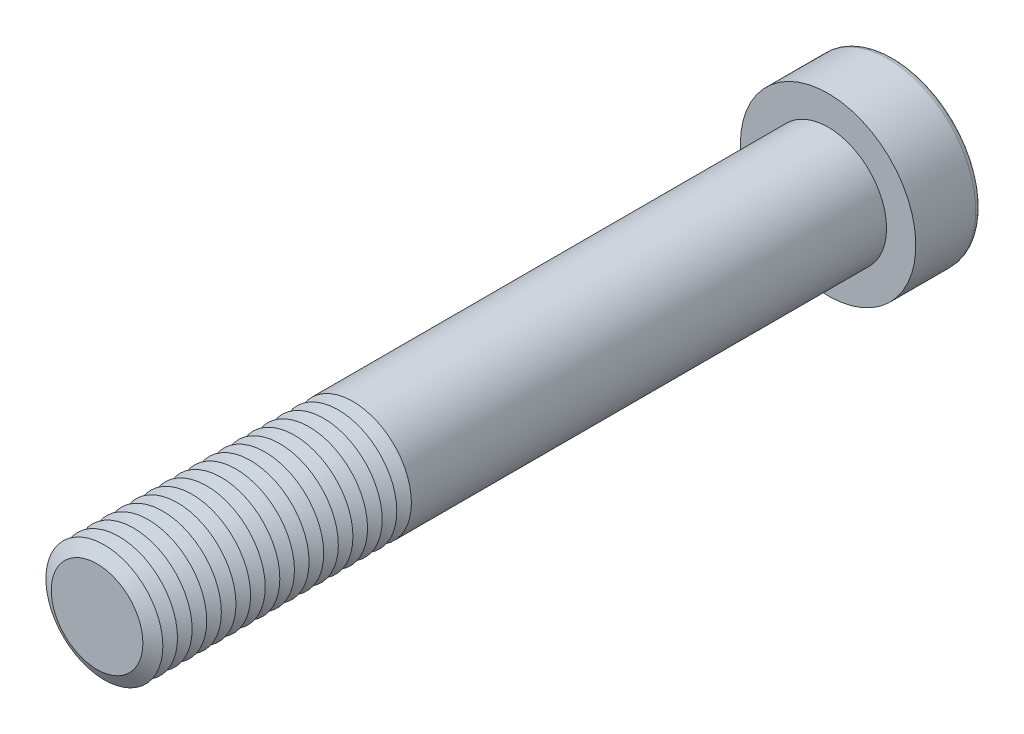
ISO-10303-21;
HEADER;
FILE_DESCRIPTION(('STEP AP214'),'2;1');
FILE_NAME('part.step','',(''),(''),'','','');
FILE_SCHEMA(('AUTOMOTIVE_DESIGN { 1 0 10303 214 1 1 1 1 }'));
ENDSEC;
DATA;
#1=APPLICATION_CONTEXT('core data for automotive mechanical design processes');
#2=APPLICATION_PROTOCOL_DEFINITION('international standard','automotive_design',2000,#1);
#3=PRODUCT_CONTEXT('',#1,'mechanical');
#4=PRODUCT('Part','Part','',(#3));
#5=PRODUCT_RELATED_PRODUCT_CATEGORY('part','',(#4));
#6=PRODUCT_DEFINITION_FORMATION('','',#4);
#7=PRODUCT_DEFINITION_CONTEXT('part definition',#1,'design');
#8=PRODUCT_DEFINITION('design','',#6,#7);
#9=PRODUCT_DEFINITION_SHAPE('','',#8);
#10=(LENGTH_UNIT() NAMED_UNIT(*) SI_UNIT(.MILLI.,.METRE.));
#11=(NAMED_UNIT(*) PLANE_ANGLE_UNIT() SI_UNIT($,.RADIAN.));
#12=(NAMED_UNIT(*) SI_UNIT($,.STERADIAN.) SOLID_ANGLE_UNIT());
#13=UNCERTAINTY_MEASURE_WITH_UNIT(LENGTH_MEASURE(1.E-05),#10,'distance_accuracy_value','');
#14=(GEOMETRIC_REPRESENTATION_CONTEXT(3) GLOBAL_UNCERTAINTY_ASSIGNED_CONTEXT((#13)) GLOBAL_UNIT_ASSIGNED_CONTEXT((#10,
#11,#12)) REPRESENTATION_CONTEXT('',''));
#15=CARTESIAN_POINT('',(0.,0.,0.));
#16=DIRECTION('',(0.,0.,1.));
#17=DIRECTION('',(1.,0.,0.));
#18=AXIS2_PLACEMENT_3D('',#15,#16,#17);
#19=CARTESIAN_POINT('',(0.,0.,93.));
#20=DIRECTION('',(0.,0.,1.));
#21=DIRECTION('',(1.,0.,0.));
#22=AXIS2_PLACEMENT_3D('',#19,#20,#21);
#23=CONICAL_SURFACE('',#22,8.,1.0471975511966);
#24=CARTESIAN_POINT('',(0.,0.,92.));
#25=DIRECTION('',(0.,0.,1.));
#26=DIRECTION('',(1.,0.,0.));
#27=AXIS2_PLACEMENT_3D('',#24,#25,#26);
#28=CIRCLE('',#27,6.26794919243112);
#29=CARTESIAN_POINT('',(6.26794919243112,0.,92.));
#30=VERTEX_POINT('',#29);
#31=EDGE_CURVE('E314',#30,#30,#28,.T.);
#32=ORIENTED_EDGE('',*,*,#31,.T.);
#33=EDGE_LOOP('',(#32));
#34=FACE_BOUND('',#33,.T.);
#35=CARTESIAN_POINT('',(0.,0.,93.));
#36=DIRECTION('',(0.,0.,1.));
#37=DIRECTION('',(1.,0.,0.));
#38=AXIS2_PLACEMENT_3D('',#35,#36,#37);
#39=CIRCLE('',#38,8.);
#40=CARTESIAN_POINT('',(8.,0.,93.));
#41=VERTEX_POINT('',#40);
#42=EDGE_CURVE('E317',#41,#41,#39,.T.);
#43=ORIENTED_EDGE('',*,*,#42,.F.);
#44=EDGE_LOOP('',(#43));
#45=FACE_BOUND('',#44,.T.);
#46=ADVANCED_FACE('F39',(#34,#45),#23,.T.);
#47=CARTESIAN_POINT('',(0.,0.,92.));
#48=DIRECTION('',(0.,0.,-1.));
#49=DIRECTION('',(-1.,0.,0.));
#50=AXIS2_PLACEMENT_3D('',#47,#48,#49);
#51=CONICAL_SURFACE('',#50,6.26794919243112,1.0471975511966);
#52=CARTESIAN_POINT('',(0.,0.,91.));
#53=DIRECTION('',(0.,0.,1.));
#54=DIRECTION('',(1.,0.,0.));
#55=AXIS2_PLACEMENT_3D('',#52,#53,#54);
#56=CIRCLE('',#55,8.);
#57=CARTESIAN_POINT('',(8.,0.,91.));
#58=VERTEX_POINT('',#57);
#59=EDGE_CURVE('E325',#58,#58,#56,.T.);
#60=ORIENTED_EDGE('',*,*,#59,.T.);
#61=EDGE_LOOP('',(#60));
#62=FACE_BOUND('',#61,.T.);
#63=ORIENTED_EDGE('',*,*,#31,.F.);
#64=EDGE_LOOP('',(#63));
#65=FACE_BOUND('',#64,.T.);
#66=ADVANCED_FACE('F245',(#62,#65),#51,.T.);
#67=CARTESIAN_POINT('',(0.,0.,100.));
#68=DIRECTION('',(0.,0.,1.));
#69=DIRECTION('',(1.,0.,0.));
#70=AXIS2_PLACEMENT_3D('',#67,#68,#69);
#71=PLANE('',#70);
#72=CARTESIAN_POINT('',(0.,0.,100.));
#73=DIRECTION('',(0.,0.,1.));
#74=DIRECTION('',(1.,0.,0.));
#75=AXIS2_PLACEMENT_3D('',#72,#73,#74);
#76=CIRCLE('',#75,6.26794919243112);
#77=CARTESIAN_POINT('',(6.26794919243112,0.,100.));
#78=VERTEX_POINT('',#77);
#79=EDGE_CURVE('E174',#78,#78,#76,.T.);
#80=ORIENTED_EDGE('',*,*,#79,.T.);
#81=EDGE_LOOP('',(#80));
#82=FACE_BOUND('',#81,.T.);
#83=ADVANCED_FACE('F251',(#82),#71,.T.);
#84=CARTESIAN_POINT('',(0.,0.,100.));
#85=DIRECTION('',(0.,0.,-1.));
#86=DIRECTION('',(-1.,0.,0.));
#87=AXIS2_PLACEMENT_3D('',#84,#85,#86);
#88=CONICAL_SURFACE('',#87,6.26794919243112,1.0471975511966);
#89=CARTESIAN_POINT('',(0.,0.,99.));
#90=DIRECTION('',(0.,0.,1.));
#91=DIRECTION('',(1.,0.,0.));
#92=AXIS2_PLACEMENT_3D('',#89,#90,#91);
#93=CIRCLE('',#92,8.);
#94=CARTESIAN_POINT('',(8.,0.,99.));
#95=VERTEX_POINT('',#94);
#96=EDGE_CURVE('E291',#95,#95,#93,.T.);
#97=ORIENTED_EDGE('',*,*,#96,.T.);
#98=EDGE_LOOP('',(#97));
#99=FACE_BOUND('',#98,.T.);
#100=ORIENTED_EDGE('',*,*,#79,.F.);
#101=EDGE_LOOP('',(#100));
#102=FACE_BOUND('',#101,.T.);
#103=ADVANCED_FACE('F199',(#99,#102),#88,.T.);
#104=CARTESIAN_POINT('',(0.,0.,99.));
#105=DIRECTION('',(0.,0.,1.));
#106=DIRECTION('',(1.,0.,0.));
#107=AXIS2_PLACEMENT_3D('',#104,#105,#106);
#108=CONICAL_SURFACE('',#107,8.,1.0471975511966);
#109=CARTESIAN_POINT('',(0.,0.,98.));
#110=DIRECTION('',(0.,0.,1.));
#111=DIRECTION('',(1.,0.,0.));
#112=AXIS2_PLACEMENT_3D('',#109,#110,#111);
#113=CIRCLE('',#112,6.26794919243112);
#114=CARTESIAN_POINT('',(6.26794919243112,0.,98.));
#115=VERTEX_POINT('',#114);
#116=EDGE_CURVE('E288',#115,#115,#113,.T.);
#117=ORIENTED_EDGE('',*,*,#116,.T.);
#118=EDGE_LOOP('',(#117));
#119=FACE_BOUND('',#118,.T.);
#120=ORIENTED_EDGE('',*,*,#96,.F.);
#121=EDGE_LOOP('',(#120));
#122=FACE_BOUND('',#121,.T.);
#123=ADVANCED_FACE('F277',(#119,#122),#108,.T.);
#124=CARTESIAN_POINT('',(0.,0.,98.));
#125=DIRECTION('',(0.,0.,-1.));
#126=DIRECTION('',(-1.,0.,0.));
#127=AXIS2_PLACEMENT_3D('',#124,#125,#126);
#128=CONICAL_SURFACE('',#127,6.26794919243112,1.0471975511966);
#129=CARTESIAN_POINT('',(0.,0.,97.));
#130=DIRECTION('',(0.,0.,1.));
#131=DIRECTION('',(1.,0.,0.));
#132=AXIS2_PLACEMENT_3D('',#129,#130,#131);
#133=CIRCLE('',#132,8.);
#134=CARTESIAN_POINT('',(8.,0.,97.));
#135=VERTEX_POINT('',#134);
#136=EDGE_CURVE('E300',#135,#135,#133,.T.);
#137=ORIENTED_EDGE('',*,*,#136,.T.);
#138=EDGE_LOOP('',(#137));
#139=FACE_BOUND('',#138,.T.);
#140=ORIENTED_EDGE('',*,*,#116,.F.);
#141=EDGE_LOOP('',(#140));
#142=FACE_BOUND('',#141,.T.);
#143=ADVANCED_FACE('F274',(#139,#142),#128,.T.);
#144=CARTESIAN_POINT('',(0.,0.,97.));
#145=DIRECTION('',(0.,0.,1.));
#146=DIRECTION('',(1.,0.,0.));
#147=AXIS2_PLACEMENT_3D('',#144,#145,#146);
#148=CONICAL_SURFACE('',#147,8.,1.0471975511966);
#149=CARTESIAN_POINT('',(0.,0.,96.));
#150=DIRECTION('',(0.,0.,1.));
#151=DIRECTION('',(1.,0.,0.));
#152=AXIS2_PLACEMENT_3D('',#149,#150,#151);
#153=CIRCLE('',#152,6.26794919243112);
#154=CARTESIAN_POINT('',(6.26794919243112,0.,96.));
#155=VERTEX_POINT('',#154);
#156=EDGE_CURVE('E293',#155,#155,#153,.T.);
#157=ORIENTED_EDGE('',*,*,#156,.T.);
#158=EDGE_LOOP('',(#157));
#159=FACE_BOUND('',#158,.T.);
#160=ORIENTED_EDGE('',*,*,#136,.F.);
#161=EDGE_LOOP('',(#160));
#162=FACE_BOUND('',#161,.T.);
#163=ADVANCED_FACE('F270',(#159,#162),#148,.T.);
#164=CARTESIAN_POINT('',(0.,0.,96.));
#165=DIRECTION('',(0.,0.,-1.));
#166=DIRECTION('',(-1.,0.,0.));
#167=AXIS2_PLACEMENT_3D('',#164,#165,#166);
#168=CONICAL_SURFACE('',#167,6.26794919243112,1.0471975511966);
#169=CARTESIAN_POINT('',(0.,0.,95.));
#170=DIRECTION('',(0.,0.,1.));
#171=DIRECTION('',(1.,0.,0.));
#172=AXIS2_PLACEMENT_3D('',#169,#170,#171);
#173=CIRCLE('',#172,8.);
#174=CARTESIAN_POINT('',(8.,0.,95.));
#175=VERTEX_POINT('',#174);
#176=EDGE_CURVE('E310',#175,#175,#173,.T.);
#177=ORIENTED_EDGE('',*,*,#176,.T.);
#178=EDGE_LOOP('',(#177));
#179=FACE_BOUND('',#178,.T.);
#180=ORIENTED_EDGE('',*,*,#156,.F.);
#181=EDGE_LOOP('',(#180));
#182=FACE_BOUND('',#181,.T.);
#183=ADVANCED_FACE('F266',(#179,#182),#168,.T.);
#184=CARTESIAN_POINT('',(0.,0.,95.));
#185=DIRECTION('',(0.,0.,1.));
#186=DIRECTION('',(1.,0.,0.));
#187=AXIS2_PLACEMENT_3D('',#184,#185,#186);
#188=CONICAL_SURFACE('',#187,8.,1.0471975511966);
#189=CARTESIAN_POINT('',(0.,0.,94.));
#190=DIRECTION('',(0.,0.,1.));
#191=DIRECTION('',(1.,0.,0.));
#192=AXIS2_PLACEMENT_3D('',#189,#190,#191);
#193=CIRCLE('',#192,6.26794919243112);
#194=CARTESIAN_POINT('',(6.26794919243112,0.,94.));
#195=VERTEX_POINT('',#194);
#196=EDGE_CURVE('E306',#195,#195,#193,.T.);
#197=ORIENTED_EDGE('',*,*,#196,.T.);
#198=EDGE_LOOP('',(#197));
#199=FACE_BOUND('',#198,.T.);
#200=ORIENTED_EDGE('',*,*,#176,.F.);
#201=EDGE_LOOP('',(#200));
#202=FACE_BOUND('',#201,.T.);
#203=ADVANCED_FACE('F262',(#199,#202),#188,.T.);
#204=CARTESIAN_POINT('',(0.,0.,94.));
#205=DIRECTION('',(0.,0.,-1.));
#206=DIRECTION('',(-1.,0.,0.));
#207=AXIS2_PLACEMENT_3D('',#204,#205,#206);
#208=CONICAL_SURFACE('',#207,6.26794919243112,1.0471975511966);
#209=ORIENTED_EDGE('',*,*,#42,.T.);
#210=EDGE_LOOP('',(#209));
#211=FACE_BOUND('',#210,.T.);
#212=ORIENTED_EDGE('',*,*,#196,.F.);
#213=EDGE_LOOP('',(#212));
#214=FACE_BOUND('',#213,.T.);
#215=ADVANCED_FACE('F258',(#211,#214),#208,.T.);
#216=CARTESIAN_POINT('',(0.,0.,91.));
#217=DIRECTION('',(0.,0.,1.));
#218=DIRECTION('',(1.,0.,0.));
#219=AXIS2_PLACEMENT_3D('',#216,#217,#218);
#220=CONICAL_SURFACE('',#219,8.,1.0471975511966);
#221=CARTESIAN_POINT('',(0.,0.,90.));
#222=DIRECTION('',(0.,0.,1.));
#223=DIRECTION('',(1.,0.,0.));
#224=AXIS2_PLACEMENT_3D('',#221,#222,#223);
#225=CIRCLE('',#224,6.26794919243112);
#226=CARTESIAN_POINT('',(6.26794919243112,0.,90.));
#227=VERTEX_POINT('',#226);
#228=EDGE_CURVE('E321',#227,#227,#225,.T.);
#229=ORIENTED_EDGE('',*,*,#228,.T.);
#230=EDGE_LOOP('',(#229));
#231=FACE_BOUND('',#230,.T.);
#232=ORIENTED_EDGE('',*,*,#59,.F.);
#233=EDGE_LOOP('',(#232));
#234=FACE_BOUND('',#233,.T.);
#235=ADVANCED_FACE('F261',(#231,#234),#220,.T.);
#236=CARTESIAN_POINT('',(0.,0.,90.));
#237=DIRECTION('',(0.,0.,-1.));
#238=DIRECTION('',(-1.,0.,0.));
#239=AXIS2_PLACEMENT_3D('',#236,#237,#238);
#240=CONICAL_SURFACE('',#239,6.26794919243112,1.0471975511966);
#241=CARTESIAN_POINT('',(0.,0.,89.));
#242=DIRECTION('',(0.,0.,1.));
#243=DIRECTION('',(1.,0.,0.));
#244=AXIS2_PLACEMENT_3D('',#241,#242,#243);
#245=CIRCLE('',#244,8.);
#246=CARTESIAN_POINT('',(8.,0.,89.));
#247=VERTEX_POINT('',#246);
#248=EDGE_CURVE('E333',#247,#247,#245,.T.);
#249=ORIENTED_EDGE('',*,*,#248,.T.);
#250=EDGE_LOOP('',(#249));
#251=FACE_BOUND('',#250,.T.);
#252=ORIENTED_EDGE('',*,*,#228,.F.);
#253=EDGE_LOOP('',(#252));
#254=FACE_BOUND('',#253,.T.);
#255=ADVANCED_FACE('F528',(#251,#254),#240,.T.);
#256=CARTESIAN_POINT('',(0.,0.,89.));
#257=DIRECTION('',(0.,0.,1.));
#258=DIRECTION('',(1.,0.,0.));
#259=AXIS2_PLACEMENT_3D('',#256,#257,#258);
#260=CONICAL_SURFACE('',#259,8.,1.0471975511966);
#261=CARTESIAN_POINT('',(0.,0.,88.));
#262=DIRECTION('',(0.,0.,1.));
#263=DIRECTION('',(1.,0.,0.));
#264=AXIS2_PLACEMENT_3D('',#261,#262,#263);
#265=CIRCLE('',#264,6.26794919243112);
#266=CARTESIAN_POINT('',(6.26794919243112,0.,88.));
#267=VERTEX_POINT('',#266);
#268=EDGE_CURVE('E329',#267,#267,#265,.T.);
#269=ORIENTED_EDGE('',*,*,#268,.T.);
#270=EDGE_LOOP('',(#269));
#271=FACE_BOUND('',#270,.T.);
#272=ORIENTED_EDGE('',*,*,#248,.F.);
#273=EDGE_LOOP('',(#272));
#274=FACE_BOUND('',#273,.T.);
#275=ADVANCED_FACE('F524',(#271,#274),#260,.T.);
#276=CARTESIAN_POINT('',(0.,0.,88.));
#277=DIRECTION('',(0.,0.,-1.));
#278=DIRECTION('',(-1.,0.,0.));
#279=AXIS2_PLACEMENT_3D('',#276,#277,#278);
#280=CONICAL_SURFACE('',#279,6.26794919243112,1.0471975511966);
#281=CARTESIAN_POINT('',(0.,0.,87.));
#282=DIRECTION('',(0.,0.,1.));
#283=DIRECTION('',(1.,0.,0.));
#284=AXIS2_PLACEMENT_3D('',#281,#282,#283);
#285=CIRCLE('',#284,8.);
#286=CARTESIAN_POINT('',(8.,0.,87.));
#287=VERTEX_POINT('',#286);
#288=EDGE_CURVE('E341',#287,#287,#285,.T.);
#289=ORIENTED_EDGE('',*,*,#288,.T.);
#290=EDGE_LOOP('',(#289));
#291=FACE_BOUND('',#290,.T.);
#292=ORIENTED_EDGE('',*,*,#268,.F.);
#293=EDGE_LOOP('',(#292));
#294=FACE_BOUND('',#293,.T.);
#295=ADVANCED_FACE('F520',(#291,#294),#280,.T.);
#296=CARTESIAN_POINT('',(0.,0.,87.));
#297=DIRECTION('',(0.,0.,1.));
#298=DIRECTION('',(1.,0.,0.));
#299=AXIS2_PLACEMENT_3D('',#296,#297,#298);
#300=CONICAL_SURFACE('',#299,8.,1.0471975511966);
#301=CARTESIAN_POINT('',(0.,0.,86.));
#302=DIRECTION('',(0.,0.,1.));
#303=DIRECTION('',(1.,0.,0.));
#304=AXIS2_PLACEMENT_3D('',#301,#302,#303);
#305=CIRCLE('',#304,6.26794919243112);
#306=CARTESIAN_POINT('',(6.26794919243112,0.,86.));
#307=VERTEX_POINT('',#306);
#308=EDGE_CURVE('E337',#307,#307,#305,.T.);
#309=ORIENTED_EDGE('',*,*,#308,.T.);
#310=EDGE_LOOP('',(#309));
#311=FACE_BOUND('',#310,.T.);
#312=ORIENTED_EDGE('',*,*,#288,.F.);
#313=EDGE_LOOP('',(#312));
#314=FACE_BOUND('',#313,.T.);
#315=ADVANCED_FACE('F516',(#311,#314),#300,.T.);
#316=CARTESIAN_POINT('',(0.,0.,86.));
#317=DIRECTION('',(0.,0.,-1.));
#318=DIRECTION('',(-1.,0.,0.));
#319=AXIS2_PLACEMENT_3D('',#316,#317,#318);
#320=CONICAL_SURFACE('',#319,6.26794919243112,1.0471975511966);
#321=CARTESIAN_POINT('',(0.,0.,85.));
#322=DIRECTION('',(0.,0.,1.));
#323=DIRECTION('',(1.,0.,0.));
#324=AXIS2_PLACEMENT_3D('',#321,#322,#323);
#325=CIRCLE('',#324,8.);
#326=CARTESIAN_POINT('',(8.,0.,85.));
#327=VERTEX_POINT('',#326);
#328=EDGE_CURVE('E349',#327,#327,#325,.T.);
#329=ORIENTED_EDGE('',*,*,#328,.T.);
#330=EDGE_LOOP('',(#329));
#331=FACE_BOUND('',#330,.T.);
#332=ORIENTED_EDGE('',*,*,#308,.F.);
#333=EDGE_LOOP('',(#332));
#334=FACE_BOUND('',#333,.T.);
#335=ADVANCED_FACE('F512',(#331,#334),#320,.T.);
#336=CARTESIAN_POINT('',(0.,0.,85.));
#337=DIRECTION('',(0.,0.,1.));
#338=DIRECTION('',(1.,0.,0.));
#339=AXIS2_PLACEMENT_3D('',#336,#337,#338);
#340=CONICAL_SURFACE('',#339,8.,1.0471975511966);
#341=CARTESIAN_POINT('',(0.,0.,84.));
#342=DIRECTION('',(0.,0.,1.));
#343=DIRECTION('',(1.,0.,0.));
#344=AXIS2_PLACEMENT_3D('',#341,#342,#343);
#345=CIRCLE('',#344,6.26794919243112);
#346=CARTESIAN_POINT('',(6.26794919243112,0.,84.));
#347=VERTEX_POINT('',#346);
#348=EDGE_CURVE('E345',#347,#347,#345,.T.);
#349=ORIENTED_EDGE('',*,*,#348,.T.);
#350=EDGE_LOOP('',(#349));
#351=FACE_BOUND('',#350,.T.);
#352=ORIENTED_EDGE('',*,*,#328,.F.);
#353=EDGE_LOOP('',(#352));
#354=FACE_BOUND('',#353,.T.);
#355=ADVANCED_FACE('F508',(#351,#354),#340,.T.);
#356=CARTESIAN_POINT('',(0.,0.,84.));
#357=DIRECTION('',(0.,0.,-1.));
#358=DIRECTION('',(-1.,0.,0.));
#359=AXIS2_PLACEMENT_3D('',#356,#357,#358);
#360=CONICAL_SURFACE('',#359,6.26794919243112,1.0471975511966);
#361=CARTESIAN_POINT('',(0.,0.,83.));
#362=DIRECTION('',(0.,0.,1.));
#363=DIRECTION('',(1.,0.,0.));
#364=AXIS2_PLACEMENT_3D('',#361,#362,#363);
#365=CIRCLE('',#364,8.);
#366=CARTESIAN_POINT('',(8.,0.,83.));
#367=VERTEX_POINT('',#366);
#368=EDGE_CURVE('E357',#367,#367,#365,.T.);
#369=ORIENTED_EDGE('',*,*,#368,.T.);
#370=EDGE_LOOP('',(#369));
#371=FACE_BOUND('',#370,.T.);
#372=ORIENTED_EDGE('',*,*,#348,.F.);
#373=EDGE_LOOP('',(#372));
#374=FACE_BOUND('',#373,.T.);
#375=ADVANCED_FACE('F504',(#371,#374),#360,.T.);
#376=CARTESIAN_POINT('',(0.,0.,83.));
#377=DIRECTION('',(0.,0.,1.));
#378=DIRECTION('',(1.,0.,0.));
#379=AXIS2_PLACEMENT_3D('',#376,#377,#378);
#380=CONICAL_SURFACE('',#379,8.,1.0471975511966);
#381=CARTESIAN_POINT('',(0.,0.,82.));
#382=DIRECTION('',(0.,0.,1.));
#383=DIRECTION('',(1.,0.,0.));
#384=AXIS2_PLACEMENT_3D('',#381,#382,#383);
#385=CIRCLE('',#384,6.26794919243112);
#386=CARTESIAN_POINT('',(6.26794919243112,0.,82.));
#387=VERTEX_POINT('',#386);
#388=EDGE_CURVE('E353',#387,#387,#385,.T.);
#389=ORIENTED_EDGE('',*,*,#388,.T.);
#390=EDGE_LOOP('',(#389));
#391=FACE_BOUND('',#390,.T.);
#392=ORIENTED_EDGE('',*,*,#368,.F.);
#393=EDGE_LOOP('',(#392));
#394=FACE_BOUND('',#393,.T.);
#395=ADVANCED_FACE('F500',(#391,#394),#380,.T.);
#396=CARTESIAN_POINT('',(0.,0.,82.));
#397=DIRECTION('',(0.,0.,-1.));
#398=DIRECTION('',(-1.,0.,0.));
#399=AXIS2_PLACEMENT_3D('',#396,#397,#398);
#400=CONICAL_SURFACE('',#399,6.26794919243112,1.0471975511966);
#401=CARTESIAN_POINT('',(0.,0.,81.));
#402=DIRECTION('',(0.,0.,1.));
#403=DIRECTION('',(1.,0.,0.));
#404=AXIS2_PLACEMENT_3D('',#401,#402,#403);
#405=CIRCLE('',#404,8.);
#406=CARTESIAN_POINT('',(8.,0.,81.));
#407=VERTEX_POINT('',#406);
#408=EDGE_CURVE('E365',#407,#407,#405,.T.);
#409=ORIENTED_EDGE('',*,*,#408,.T.);
#410=EDGE_LOOP('',(#409));
#411=FACE_BOUND('',#410,.T.);
#412=ORIENTED_EDGE('',*,*,#388,.F.);
#413=EDGE_LOOP('',(#412));
#414=FACE_BOUND('',#413,.T.);
#415=ADVANCED_FACE('F496',(#411,#414),#400,.T.);
#416=CARTESIAN_POINT('',(0.,0.,81.));
#417=DIRECTION('',(0.,0.,1.));
#418=DIRECTION('',(1.,0.,0.));
#419=AXIS2_PLACEMENT_3D('',#416,#417,#418);
#420=CONICAL_SURFACE('',#419,8.,1.0471975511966);
#421=CARTESIAN_POINT('',(0.,0.,80.));
#422=DIRECTION('',(0.,0.,1.));
#423=DIRECTION('',(1.,0.,0.));
#424=AXIS2_PLACEMENT_3D('',#421,#422,#423);
#425=CIRCLE('',#424,6.26794919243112);
#426=CARTESIAN_POINT('',(6.26794919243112,0.,80.));
#427=VERTEX_POINT('',#426);
#428=EDGE_CURVE('E361',#427,#427,#425,.T.);
#429=ORIENTED_EDGE('',*,*,#428,.T.);
#430=EDGE_LOOP('',(#429));
#431=FACE_BOUND('',#430,.T.);
#432=ORIENTED_EDGE('',*,*,#408,.F.);
#433=EDGE_LOOP('',(#432));
#434=FACE_BOUND('',#433,.T.);
#435=ADVANCED_FACE('F492',(#431,#434),#420,.T.);
#436=CARTESIAN_POINT('',(0.,0.,80.));
#437=DIRECTION('',(0.,0.,-1.));
#438=DIRECTION('',(-1.,0.,0.));
#439=AXIS2_PLACEMENT_3D('',#436,#437,#438);
#440=CONICAL_SURFACE('',#439,6.26794919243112,1.0471975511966);
#441=CARTESIAN_POINT('',(0.,0.,79.));
#442=DIRECTION('',(0.,0.,1.));
#443=DIRECTION('',(1.,0.,0.));
#444=AXIS2_PLACEMENT_3D('',#441,#442,#443);
#445=CIRCLE('',#444,8.);
#446=CARTESIAN_POINT('',(8.,0.,79.));
#447=VERTEX_POINT('',#446);
#448=EDGE_CURVE('E373',#447,#447,#445,.T.);
#449=ORIENTED_EDGE('',*,*,#448,.T.);
#450=EDGE_LOOP('',(#449));
#451=FACE_BOUND('',#450,.T.);
#452=ORIENTED_EDGE('',*,*,#428,.F.);
#453=EDGE_LOOP('',(#452));
#454=FACE_BOUND('',#453,.T.);
#455=ADVANCED_FACE('F488',(#451,#454),#440,.T.);
#456=CARTESIAN_POINT('',(0.,0.,79.));
#457=DIRECTION('',(0.,0.,1.));
#458=DIRECTION('',(1.,0.,0.));
#459=AXIS2_PLACEMENT_3D('',#456,#457,#458);
#460=CONICAL_SURFACE('',#459,8.,1.0471975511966);
#461=CARTESIAN_POINT('',(0.,0.,78.));
#462=DIRECTION('',(0.,0.,1.));
#463=DIRECTION('',(1.,0.,0.));
#464=AXIS2_PLACEMENT_3D('',#461,#462,#463);
#465=CIRCLE('',#464,6.26794919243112);
#466=CARTESIAN_POINT('',(6.26794919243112,0.,78.));
#467=VERTEX_POINT('',#466);
#468=EDGE_CURVE('E369',#467,#467,#465,.T.);
#469=ORIENTED_EDGE('',*,*,#468,.T.);
#470=EDGE_LOOP('',(#469));
#471=FACE_BOUND('',#470,.T.);
#472=ORIENTED_EDGE('',*,*,#448,.F.);
#473=EDGE_LOOP('',(#472));
#474=FACE_BOUND('',#473,.T.);
#475=ADVANCED_FACE('F484',(#471,#474),#460,.T.);
#476=CARTESIAN_POINT('',(0.,0.,78.));
#477=DIRECTION('',(0.,0.,-1.));
#478=DIRECTION('',(-1.,0.,0.));
#479=AXIS2_PLACEMENT_3D('',#476,#477,#478);
#480=CONICAL_SURFACE('',#479,6.26794919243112,1.0471975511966);
#481=CARTESIAN_POINT('',(0.,0.,77.));
#482=DIRECTION('',(0.,0.,1.));
#483=DIRECTION('',(1.,0.,0.));
#484=AXIS2_PLACEMENT_3D('',#481,#482,#483);
#485=CIRCLE('',#484,8.);
#486=CARTESIAN_POINT('',(8.,0.,77.));
#487=VERTEX_POINT('',#486);
#488=EDGE_CURVE('E380',#487,#487,#485,.T.);
#489=ORIENTED_EDGE('',*,*,#488,.T.);
#490=EDGE_LOOP('',(#489));
#491=FACE_BOUND('',#490,.T.);
#492=ORIENTED_EDGE('',*,*,#468,.F.);
#493=EDGE_LOOP('',(#492));
#494=FACE_BOUND('',#493,.T.);
#495=ADVANCED_FACE('F480',(#491,#494),#480,.T.);
#496=CARTESIAN_POINT('',(0.,0.,77.));
#497=DIRECTION('',(0.,0.,1.));
#498=DIRECTION('',(1.,0.,0.));
#499=AXIS2_PLACEMENT_3D('',#496,#497,#498);
#500=CONICAL_SURFACE('',#499,8.,1.0471975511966);
#501=CARTESIAN_POINT('',(0.,0.,76.));
#502=DIRECTION('',(0.,0.,1.));
#503=DIRECTION('',(1.,0.,0.));
#504=AXIS2_PLACEMENT_3D('',#501,#502,#503);
#505=CIRCLE('',#504,6.26794919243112);
#506=CARTESIAN_POINT('',(6.26794919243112,0.,76.));
#507=VERTEX_POINT('',#506);
#508=EDGE_CURVE('E376',#507,#507,#505,.T.);
#509=ORIENTED_EDGE('',*,*,#508,.T.);
#510=EDGE_LOOP('',(#509));
#511=FACE_BOUND('',#510,.T.);
#512=ORIENTED_EDGE('',*,*,#488,.F.);
#513=EDGE_LOOP('',(#512));
#514=FACE_BOUND('',#513,.T.);
#515=ADVANCED_FACE('F476',(#511,#514),#500,.T.);
#516=CARTESIAN_POINT('',(0.,0.,76.));
#517=DIRECTION('',(0.,0.,-1.));
#518=DIRECTION('',(-1.,0.,0.));
#519=AXIS2_PLACEMENT_3D('',#516,#517,#518);
#520=CONICAL_SURFACE('',#519,6.26794919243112,1.0471975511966);
#521=CARTESIAN_POINT('',(0.,0.,75.));
#522=DIRECTION('',(0.,0.,1.));
#523=DIRECTION('',(1.,0.,0.));
#524=AXIS2_PLACEMENT_3D('',#521,#522,#523);
#525=CIRCLE('',#524,8.);
#526=CARTESIAN_POINT('',(8.,0.,75.));
#527=VERTEX_POINT('',#526);
#528=EDGE_CURVE('E387',#527,#527,#525,.T.);
#529=ORIENTED_EDGE('',*,*,#528,.T.);
#530=EDGE_LOOP('',(#529));
#531=FACE_BOUND('',#530,.T.);
#532=ORIENTED_EDGE('',*,*,#508,.F.);
#533=EDGE_LOOP('',(#532));
#534=FACE_BOUND('',#533,.T.);
#535=ADVANCED_FACE('F472',(#531,#534),#520,.T.);
#536=CARTESIAN_POINT('',(0.,0.,75.));
#537=DIRECTION('',(0.,0.,1.));
#538=DIRECTION('',(1.,0.,0.));
#539=AXIS2_PLACEMENT_3D('',#536,#537,#538);
#540=CONICAL_SURFACE('',#539,8.,1.0471975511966);
#541=CARTESIAN_POINT('',(0.,0.,74.));
#542=DIRECTION('',(0.,0.,1.));
#543=DIRECTION('',(1.,0.,0.));
#544=AXIS2_PLACEMENT_3D('',#541,#542,#543);
#545=CIRCLE('',#544,6.26794919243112);
#546=CARTESIAN_POINT('',(6.26794919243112,0.,74.));
#547=VERTEX_POINT('',#546);
#548=EDGE_CURVE('E383',#547,#547,#545,.T.);
#549=ORIENTED_EDGE('',*,*,#548,.T.);
#550=EDGE_LOOP('',(#549));
#551=FACE_BOUND('',#550,.T.);
#552=ORIENTED_EDGE('',*,*,#528,.F.);
#553=EDGE_LOOP('',(#552));
#554=FACE_BOUND('',#553,.T.);
#555=ADVANCED_FACE('F468',(#551,#554),#540,.T.);
#556=CARTESIAN_POINT('',(0.,0.,74.));
#557=DIRECTION('',(0.,0.,-1.));
#558=DIRECTION('',(-1.,0.,0.));
#559=AXIS2_PLACEMENT_3D('',#556,#557,#558);
#560=CONICAL_SURFACE('',#559,6.26794919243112,1.0471975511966);
#561=CARTESIAN_POINT('',(0.,0.,73.));
#562=DIRECTION('',(0.,0.,1.));
#563=DIRECTION('',(1.,0.,0.));
#564=AXIS2_PLACEMENT_3D('',#561,#562,#563);
#565=CIRCLE('',#564,8.);
#566=CARTESIAN_POINT('',(8.,0.,73.));
#567=VERTEX_POINT('',#566);
#568=EDGE_CURVE('E395',#567,#567,#565,.T.);
#569=ORIENTED_EDGE('',*,*,#568,.T.);
#570=EDGE_LOOP('',(#569));
#571=FACE_BOUND('',#570,.T.);
#572=ORIENTED_EDGE('',*,*,#548,.F.);
#573=EDGE_LOOP('',(#572));
#574=FACE_BOUND('',#573,.T.);
#575=ADVANCED_FACE('F464',(#571,#574),#560,.T.);
#576=CARTESIAN_POINT('',(0.,0.,73.));
#577=DIRECTION('',(0.,0.,1.));
#578=DIRECTION('',(1.,0.,0.));
#579=AXIS2_PLACEMENT_3D('',#576,#577,#578);
#580=CONICAL_SURFACE('',#579,8.,1.0471975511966);
#581=CARTESIAN_POINT('',(0.,0.,72.));
#582=DIRECTION('',(0.,0.,1.));
#583=DIRECTION('',(1.,0.,0.));
#584=AXIS2_PLACEMENT_3D('',#581,#582,#583);
#585=CIRCLE('',#584,6.26794919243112);
#586=CARTESIAN_POINT('',(6.26794919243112,0.,72.));
#587=VERTEX_POINT('',#586);
#588=EDGE_CURVE('E391',#587,#587,#585,.T.);
#589=ORIENTED_EDGE('',*,*,#588,.T.);
#590=EDGE_LOOP('',(#589));
#591=FACE_BOUND('',#590,.T.);
#592=ORIENTED_EDGE('',*,*,#568,.F.);
#593=EDGE_LOOP('',(#592));
#594=FACE_BOUND('',#593,.T.);
#595=ADVANCED_FACE('F460',(#591,#594),#580,.T.);
#596=CARTESIAN_POINT('',(0.,0.,72.));
#597=DIRECTION('',(0.,0.,-1.));
#598=DIRECTION('',(-1.,0.,0.));
#599=AXIS2_PLACEMENT_3D('',#596,#597,#598);
#600=CONICAL_SURFACE('',#599,6.26794919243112,1.0471975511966);
#601=CARTESIAN_POINT('',(0.,0.,71.));
#602=DIRECTION('',(0.,0.,1.));
#603=DIRECTION('',(1.,0.,0.));
#604=AXIS2_PLACEMENT_3D('',#601,#602,#603);
#605=CIRCLE('',#604,8.);
#606=CARTESIAN_POINT('',(8.,0.,71.));
#607=VERTEX_POINT('',#606);
#608=EDGE_CURVE('E403',#607,#607,#605,.T.);
#609=ORIENTED_EDGE('',*,*,#608,.T.);
#610=EDGE_LOOP('',(#609));
#611=FACE_BOUND('',#610,.T.);
#612=ORIENTED_EDGE('',*,*,#588,.F.);
#613=EDGE_LOOP('',(#612));
#614=FACE_BOUND('',#613,.T.);
#615=ADVANCED_FACE('F456',(#611,#614),#600,.T.);
#616=CARTESIAN_POINT('',(0.,0.,71.));
#617=DIRECTION('',(0.,0.,1.));
#618=DIRECTION('',(1.,0.,0.));
#619=AXIS2_PLACEMENT_3D('',#616,#617,#618);
#620=CONICAL_SURFACE('',#619,8.,1.0471975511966);
#621=CARTESIAN_POINT('',(0.,0.,70.));
#622=DIRECTION('',(0.,0.,1.));
#623=DIRECTION('',(1.,0.,0.));
#624=AXIS2_PLACEMENT_3D('',#621,#622,#623);
#625=CIRCLE('',#624,6.26794919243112);
#626=CARTESIAN_POINT('',(6.26794919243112,0.,70.));
#627=VERTEX_POINT('',#626);
#628=EDGE_CURVE('E399',#627,#627,#625,.T.);
#629=ORIENTED_EDGE('',*,*,#628,.T.);
#630=EDGE_LOOP('',(#629));
#631=FACE_BOUND('',#630,.T.);
#632=ORIENTED_EDGE('',*,*,#608,.F.);
#633=EDGE_LOOP('',(#632));
#634=FACE_BOUND('',#633,.T.);
#635=ADVANCED_FACE('F452',(#631,#634),#620,.T.);
#636=CARTESIAN_POINT('',(0.,0.,70.));
#637=DIRECTION('',(0.,0.,-1.));
#638=DIRECTION('',(-1.,0.,0.));
#639=AXIS2_PLACEMENT_3D('',#636,#637,#638);
#640=CONICAL_SURFACE('',#639,6.26794919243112,1.0471975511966);
#641=CARTESIAN_POINT('',(0.,0.,69.));
#642=DIRECTION('',(0.,0.,1.));
#643=DIRECTION('',(1.,0.,0.));
#644=AXIS2_PLACEMENT_3D('',#641,#642,#643);
#645=CIRCLE('',#644,8.);
#646=CARTESIAN_POINT('',(8.,0.,69.));
#647=VERTEX_POINT('',#646);
#648=EDGE_CURVE('E411',#647,#647,#645,.T.);
#649=ORIENTED_EDGE('',*,*,#648,.T.);
#650=EDGE_LOOP('',(#649));
#651=FACE_BOUND('',#650,.T.);
#652=ORIENTED_EDGE('',*,*,#628,.F.);
#653=EDGE_LOOP('',(#652));
#654=FACE_BOUND('',#653,.T.);
#655=ADVANCED_FACE('F448',(#651,#654),#640,.T.);
#656=CARTESIAN_POINT('',(0.,0.,69.));
#657=DIRECTION('',(0.,0.,1.));
#658=DIRECTION('',(1.,0.,0.));
#659=AXIS2_PLACEMENT_3D('',#656,#657,#658);
#660=CONICAL_SURFACE('',#659,8.,1.0471975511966);
#661=CARTESIAN_POINT('',(0.,0.,68.));
#662=DIRECTION('',(0.,0.,1.));
#663=DIRECTION('',(1.,0.,0.));
#664=AXIS2_PLACEMENT_3D('',#661,#662,#663);
#665=CIRCLE('',#664,6.26794919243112);
#666=CARTESIAN_POINT('',(6.26794919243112,0.,68.));
#667=VERTEX_POINT('',#666);
#668=EDGE_CURVE('E407',#667,#667,#665,.T.);
#669=ORIENTED_EDGE('',*,*,#668,.T.);
#670=EDGE_LOOP('',(#669));
#671=FACE_BOUND('',#670,.T.);
#672=ORIENTED_EDGE('',*,*,#648,.F.);
#673=EDGE_LOOP('',(#672));
#674=FACE_BOUND('',#673,.T.);
#675=ADVANCED_FACE('F443',(#671,#674),#660,.T.);
#676=CARTESIAN_POINT('',(0.,0.,68.));
#677=DIRECTION('',(0.,0.,-1.));
#678=DIRECTION('',(-1.,0.,0.));
#679=AXIS2_PLACEMENT_3D('',#676,#677,#678);
#680=CONICAL_SURFACE('',#679,6.26794919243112,1.0471975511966);
#681=CARTESIAN_POINT('',(0.,0.,67.));
#682=DIRECTION('',(0.,0.,1.));
#683=DIRECTION('',(1.,0.,0.));
#684=AXIS2_PLACEMENT_3D('',#681,#682,#683);
#685=CIRCLE('',#684,8.);
#686=CARTESIAN_POINT('',(8.,0.,67.));
#687=VERTEX_POINT('',#686);
#688=EDGE_CURVE('E423',#687,#687,#685,.T.);
#689=ORIENTED_EDGE('',*,*,#688,.T.);
#690=EDGE_LOOP('',(#689));
#691=FACE_BOUND('',#690,.T.);
#692=ORIENTED_EDGE('',*,*,#668,.F.);
#693=EDGE_LOOP('',(#692));
#694=FACE_BOUND('',#693,.T.);
#695=ADVANCED_FACE('F429',(#691,#694),#680,.T.);
#696=CARTESIAN_POINT('',(0.,0.,67.));
#697=DIRECTION('',(0.,0.,1.));
#698=DIRECTION('',(1.,0.,0.));
#699=AXIS2_PLACEMENT_3D('',#696,#697,#698);
#700=CONICAL_SURFACE('',#699,8.,1.0471975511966);
#701=CARTESIAN_POINT('',(0.,0.,66.));
#702=DIRECTION('',(0.,0.,1.));
#703=DIRECTION('',(1.,0.,0.));
#704=AXIS2_PLACEMENT_3D('',#701,#702,#703);
#705=CIRCLE('',#704,6.26794919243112);
#706=CARTESIAN_POINT('',(6.26794919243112,0.,66.));
#707=VERTEX_POINT('',#706);
#708=EDGE_CURVE('E415',#707,#707,#705,.T.);
#709=ORIENTED_EDGE('',*,*,#708,.T.);
#710=EDGE_LOOP('',(#709));
#711=FACE_BOUND('',#710,.T.);
#712=ORIENTED_EDGE('',*,*,#688,.F.);
#713=EDGE_LOOP('',(#712));
#714=FACE_BOUND('',#713,.T.);
#715=ADVANCED_FACE('F432',(#711,#714),#700,.T.);
#716=CARTESIAN_POINT('',(0.,0.,66.));
#717=DIRECTION('',(0.,0.,-1.));
#718=DIRECTION('',(-1.,0.,0.));
#719=AXIS2_PLACEMENT_3D('',#716,#717,#718);
#720=CONICAL_SURFACE('',#719,6.26794919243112,1.0471975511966);
#721=CARTESIAN_POINT('',(0.,0.,65.));
#722=DIRECTION('',(0.,0.,1.));
#723=DIRECTION('',(1.,0.,0.));
#724=AXIS2_PLACEMENT_3D('',#721,#722,#723);
#725=CIRCLE('',#724,8.);
#726=CARTESIAN_POINT('',(8.,0.,65.));
#727=VERTEX_POINT('',#726);
#728=EDGE_CURVE('E419',#727,#727,#725,.T.);
#729=ORIENTED_EDGE('',*,*,#728,.T.);
#730=EDGE_LOOP('',(#729));
#731=FACE_BOUND('',#730,.T.);
#732=ORIENTED_EDGE('',*,*,#708,.F.);
#733=EDGE_LOOP('',(#732));
#734=FACE_BOUND('',#733,.T.);
#735=ADVANCED_FACE('F434',(#731,#734),#720,.T.);
#736=CARTESIAN_POINT('',(0.,0.,0.));
#737=DIRECTION('',(0.,0.,-1.));
#738=DIRECTION('',(-1.,0.,0.));
#739=AXIS2_PLACEMENT_3D('',#736,#737,#738);
#740=CONICAL_SURFACE('',#739,6.,1.0471975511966);
#741=CARTESIAN_POINT('',(0.,0.,3.46410161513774));
#742=VERTEX_POINT('',#741);
#743=VERTEX_LOOP('',#742);
#744=FACE_BOUND('',#743,.T.);
#745=CARTESIAN_POINT('',(0.,0.,0.));
#746=DIRECTION('',(0.,0.,-1.));
#747=DIRECTION('',(-1.,0.,0.));
#748=AXIS2_PLACEMENT_3D('',#745,#746,#747);
#749=CIRCLE('',#748,6.);
#750=CARTESIAN_POINT('',(-5.19615242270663,3.,0.));
#751=VERTEX_POINT('',#750);
#752=CARTESIAN_POINT('',(0.,6.,0.));
#753=VERTEX_POINT('',#752);
#754=EDGE_CURVE('E149',#751,#753,#749,.T.);
#755=ORIENTED_EDGE('',*,*,#754,.T.);
#756=CARTESIAN_POINT('',(0.,0.,0.));
#757=DIRECTION('',(0.,0.,-1.));
#758=DIRECTION('',(-1.,0.,0.));
#759=AXIS2_PLACEMENT_3D('',#756,#757,#758);
#760=CIRCLE('',#759,6.);
#761=CARTESIAN_POINT('',(5.19615242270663,3.,0.));
#762=VERTEX_POINT('',#761);
#763=EDGE_CURVE('E54',#753,#762,#760,.T.);
#764=ORIENTED_EDGE('',*,*,#763,.T.);
#765=CARTESIAN_POINT('',(5.19615242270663,-3.,0.));
#766=VERTEX_POINT('',#765);
#767=EDGE_CURVE('E1058',#762,#766,#760,.T.);
#768=ORIENTED_EDGE('',*,*,#767,.T.);
#769=CARTESIAN_POINT('',(0.,-6.,0.));
#770=VERTEX_POINT('',#769);
#771=EDGE_CURVE('E1056',#766,#770,#760,.T.);
#772=ORIENTED_EDGE('',*,*,#771,.T.);
#773=CARTESIAN_POINT('',(-5.19615242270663,-3.,0.));
#774=VERTEX_POINT('',#773);
#775=EDGE_CURVE('E1050',#770,#774,#760,.T.);
#776=ORIENTED_EDGE('',*,*,#775,.T.);
#777=EDGE_CURVE('E1048',#774,#751,#760,.T.);
#778=ORIENTED_EDGE('',*,*,#777,.T.);
#779=EDGE_LOOP('',(#755,#764,#768,#772,#776,#778));
#780=FACE_BOUND('',#779,.T.);
#781=ADVANCED_FACE('F201',(#744,#780),#740,.F.);
#782=CARTESIAN_POINT('',(0.,0.,0.));
#783=DIRECTION('',(0.,0.,-1.));
#784=DIRECTION('',(-1.,0.,0.));
#785=AXIS2_PLACEMENT_3D('',#782,#783,#784);
#786=PLANE('',#785);
#787=ORIENTED_EDGE('',*,*,#763,.F.);
#788=DIRECTION('',(1.,0.,0.));
#789=VECTOR('',#788,1.);
#790=CARTESIAN_POINT('',(-3.46410161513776,6.,0.));
#791=LINE('',#790,#789);
#792=CARTESIAN_POINT('',(3.46410161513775,6.,0.));
#793=VERTEX_POINT('',#792);
#794=EDGE_CURVE('E1096',#753,#793,#791,.T.);
#795=ORIENTED_EDGE('',*,*,#794,.T.);
#796=DIRECTION('',(0.5,-0.866025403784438,0.));
#797=VECTOR('',#796,1.);
#798=CARTESIAN_POINT('',(3.46410161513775,6.,0.));
#799=LINE('',#798,#797);
#800=EDGE_CURVE('E155',#793,#762,#799,.T.);
#801=ORIENTED_EDGE('',*,*,#800,.T.);
#802=EDGE_LOOP('',(#787,#795,#801));
#803=FACE_BOUND('',#802,.T.);
#804=ADVANCED_FACE('F629',(#803),#786,.T.);
#805=ORIENTED_EDGE('',*,*,#767,.F.);
#806=CARTESIAN_POINT('',(6.92820323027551,0.,0.));
#807=VERTEX_POINT('',#806);
#808=EDGE_CURVE('E1095',#762,#807,#799,.T.);
#809=ORIENTED_EDGE('',*,*,#808,.T.);
#810=DIRECTION('',(-0.5,-0.866025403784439,0.));
#811=VECTOR('',#810,1.);
#812=CARTESIAN_POINT('',(6.92820323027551,0.,0.));
#813=LINE('',#812,#811);
#814=EDGE_CURVE('E1070',#807,#766,#813,.T.);
#815=ORIENTED_EDGE('',*,*,#814,.T.);
#816=EDGE_LOOP('',(#805,#809,#815));
#817=FACE_BOUND('',#816,.T.);
#818=ADVANCED_FACE('F639',(#817),#786,.T.);
#819=ORIENTED_EDGE('',*,*,#771,.F.);
#820=CARTESIAN_POINT('',(3.46410161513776,-6.,0.));
#821=VERTEX_POINT('',#820);
#822=EDGE_CURVE('E1072',#766,#821,#813,.T.);
#823=ORIENTED_EDGE('',*,*,#822,.T.);
#824=DIRECTION('',(-1.,0.,0.));
#825=VECTOR('',#824,1.);
#826=CARTESIAN_POINT('',(3.46410161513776,-6.,0.));
#827=LINE('',#826,#825);
#828=EDGE_CURVE('E1023',#821,#770,#827,.T.);
#829=ORIENTED_EDGE('',*,*,#828,.T.);
#830=EDGE_LOOP('',(#819,#823,#829));
#831=FACE_BOUND('',#830,.T.);
#832=ADVANCED_FACE('F649',(#831),#786,.T.);
#833=ORIENTED_EDGE('',*,*,#775,.F.);
#834=CARTESIAN_POINT('',(-3.46410161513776,-6.,0.));
#835=VERTEX_POINT('',#834);
#836=EDGE_CURVE('E1066',#770,#835,#827,.T.);
#837=ORIENTED_EDGE('',*,*,#836,.T.);
#838=DIRECTION('',(-0.5,0.866025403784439,0.));
#839=VECTOR('',#838,1.);
#840=CARTESIAN_POINT('',(-3.46410161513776,-6.,0.));
#841=LINE('',#840,#839);
#842=EDGE_CURVE('E1068',#835,#774,#841,.T.);
#843=ORIENTED_EDGE('',*,*,#842,.T.);
#844=EDGE_LOOP('',(#833,#837,#843));
#845=FACE_BOUND('',#844,.T.);
#846=ADVANCED_FACE('F657',(#845),#786,.T.);
#847=ORIENTED_EDGE('',*,*,#777,.F.);
#848=CARTESIAN_POINT('',(-6.92820323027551,0.,0.));
#849=VERTEX_POINT('',#848);
#850=EDGE_CURVE('E1074',#774,#849,#841,.T.);
#851=ORIENTED_EDGE('',*,*,#850,.T.);
#852=DIRECTION('',(0.5,0.866025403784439,0.));
#853=VECTOR('',#852,1.);
#854=CARTESIAN_POINT('',(-6.92820323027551,0.,0.));
#855=LINE('',#854,#853);
#856=EDGE_CURVE('E158',#849,#751,#855,.T.);
#857=ORIENTED_EDGE('',*,*,#856,.T.);
#858=EDGE_LOOP('',(#847,#851,#857));
#859=FACE_BOUND('',#858,.T.);
#860=ADVANCED_FACE('F231',(#859),#786,.T.);
#861=ORIENTED_EDGE('',*,*,#754,.F.);
#862=CARTESIAN_POINT('',(-3.46410161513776,6.,0.));
#863=VERTEX_POINT('',#862);
#864=EDGE_CURVE('E1080',#751,#863,#855,.T.);
#865=ORIENTED_EDGE('',*,*,#864,.T.);
#866=EDGE_CURVE('E1092',#863,#753,#791,.T.);
#867=ORIENTED_EDGE('',*,*,#866,.T.);
#868=EDGE_LOOP('',(#861,#865,#867));
#869=FACE_BOUND('',#868,.T.);
#870=ADVANCED_FACE('F641',(#869),#786,.T.);
#871=CARTESIAN_POINT('',(-3.46410161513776,6.,0.));
#872=DIRECTION('',(0.,1.,0.));
#873=DIRECTION('',(0.,0.,1.));
#874=AXIS2_PLACEMENT_3D('',#871,#872,#873);
#875=PLANE('',#874);
#876=DIRECTION('',(0.,0.,-1.));
#877=VECTOR('',#876,1.);
#878=CARTESIAN_POINT('',(-3.46410161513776,6.,0.));
#879=LINE('',#878,#877);
#880=CARTESIAN_POINT('',(-3.46410161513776,6.,-9.));
#881=VERTEX_POINT('',#880);
#882=EDGE_CURVE('E147',#863,#881,#879,.T.);
#883=ORIENTED_EDGE('',*,*,#882,.T.);
#884=CARTESIAN_POINT('',(-9.04322275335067,6.,-10.0515506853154));
#885=CARTESIAN_POINT('',(-8.77229389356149,6.,-9.99107568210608));
#886=CARTESIAN_POINT('',(-8.50119215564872,6.,-9.93136093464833));
#887=CARTESIAN_POINT('',(-7.95855825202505,6.,-9.81386229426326));
#888=CARTESIAN_POINT('',(-7.68702606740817,6.,-9.75607848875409));
#889=CARTESIAN_POINT('',(-7.14318995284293,6.,-9.64279905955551));
#890=CARTESIAN_POINT('',(-6.87088551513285,6.,-9.58730586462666));
#891=CARTESIAN_POINT('',(-6.32570082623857,6.,-9.47922577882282));
#892=CARTESIAN_POINT('',(-6.05282058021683,6.,-9.42663886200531));
#893=CARTESIAN_POINT('',(-5.50875458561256,6.,-9.32550177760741));
#894=CARTESIAN_POINT('',(-5.23757463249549,6.,-9.27692059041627));
#895=CARTESIAN_POINT('',(-4.69446863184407,6.,-9.18413302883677));
#896=CARTESIAN_POINT('',(-4.42254260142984,6.,-9.13992655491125));
#897=CARTESIAN_POINT('',(-3.87790333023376,6.,-9.05690830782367));
#898=CARTESIAN_POINT('',(-3.6051902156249,6.,-9.0180957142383));
#899=CARTESIAN_POINT('',(-3.05890080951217,6.,-8.94703062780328));
#900=CARTESIAN_POINT('',(-2.7853245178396,6.,-8.91477813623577));
#901=CARTESIAN_POINT('',(-2.23425545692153,6.,-8.85776959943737));
#902=CARTESIAN_POINT('',(-1.95675335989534,6.,-8.83310236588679));
#903=CARTESIAN_POINT('',(-1.40107824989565,6.,-8.79298360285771));
#904=CARTESIAN_POINT('',(-1.12290525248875,6.,-8.77753186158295));
#905=CARTESIAN_POINT('',(-0.566293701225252,6.,-8.75674610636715));
#906=CARTESIAN_POINT('',(-0.28785531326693,6.,-8.75140773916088));
#907=CARTESIAN_POINT('',(0.269026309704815,6.,-8.75117360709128));
#908=CARTESIAN_POINT('',(0.547469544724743,6.,-8.75627785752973));
#909=CARTESIAN_POINT('',(1.10511819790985,6.,-8.77664719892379));
#910=CARTESIAN_POINT('',(1.38432206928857,6.,-8.79195380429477));
#911=CARTESIAN_POINT('',(1.94205759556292,6.,-8.83187108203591));
#912=CARTESIAN_POINT('',(2.22058923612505,6.,-8.85648195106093));
#913=CARTESIAN_POINT('',(2.77698779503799,6.,-8.91379497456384));
#914=CARTESIAN_POINT('',(3.0548541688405,6.,-8.94650233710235));
#915=CARTESIAN_POINT('',(3.60969614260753,6.,-9.01868375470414));
#916=CARTESIAN_POINT('',(3.8866717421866,6.,-9.0581578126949));
#917=CARTESIAN_POINT('',(4.44700464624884,6.,-9.14374886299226));
#918=CARTESIAN_POINT('',(4.73033933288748,6.,-9.190012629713));
#919=CARTESIAN_POINT('',(5.29620685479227,6.,-9.28723184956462));
#920=CARTESIAN_POINT('',(5.57873966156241,6.,-9.3381874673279));
#921=CARTESIAN_POINT('',(6.14313105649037,6.,-9.44386031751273));
#922=CARTESIAN_POINT('',(6.42498956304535,6.,-9.49857798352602));
#923=CARTESIAN_POINT('',(6.98810511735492,6.,-9.61103289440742));
#924=CARTESIAN_POINT('',(7.26936215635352,6.,-9.66877018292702));
#925=CARTESIAN_POINT('',(8.11254995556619,6.,-9.84563705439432));
#926=CARTESIAN_POINT('',(8.67372006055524,6.,-9.96838761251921));
#927=CARTESIAN_POINT('',(9.79457370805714,6.,-10.2202420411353));
#928=CARTESIAN_POINT('',(10.3542573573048,6.,-10.3493454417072));
#929=CARTESIAN_POINT('',(11.4657945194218,6.,-10.6103395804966));
#930=CARTESIAN_POINT('',(12.0176605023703,6.,-10.7421773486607));
#931=CARTESIAN_POINT('',(13.1206665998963,6.,-11.0089002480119));
#932=CARTESIAN_POINT('',(13.6718066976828,6.,-11.1437854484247));
#933=CARTESIAN_POINT('',(14.7727697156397,6.,-11.4155878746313));
#934=CARTESIAN_POINT('',(15.3225934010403,6.,-11.5525020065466));
#935=CARTESIAN_POINT('',(16.4217957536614,6.,-11.8280226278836));
#936=CARTESIAN_POINT('',(16.971174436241,6.,-11.9666290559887));
#937=CARTESIAN_POINT('',(17.5204019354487,6.,-12.1058251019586));
#938=B_SPLINE_CURVE_WITH_KNOTS('',3,(#884,#885,#886,#887,#888,#889,#890,#891,#892,#893,#894,
#895,#896,#897,#898,#899,#900,#901,#902,#903,#904,#905,#906,#907,#908,#909,#910,#911,#912,#913,
#914,#915,#916,#917,#918,#919,#920,#921,#922,#923,#924,#925,#926,#927,#928,#929,#930,#931,#932,
#933,#934,#935,#936,#937),.UNSPECIFIED.,.F.,.F.,(4,2,2,2,2,2,2,2,2,2,2,2,2,2,2,2,2,2,2,2,2,2,2,
2,2,2,4),(0.,0.832792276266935,1.6656222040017,2.49931362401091,3.33299760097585,
4.15946050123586,4.98590459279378,5.81222284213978,6.63854125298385,7.47419540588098,
8.30983035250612,9.14510552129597,9.98038191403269,10.8190780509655,11.6577919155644,
12.4970466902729,13.336301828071,14.1975135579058,15.0587555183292,15.9200969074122,
16.7814507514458,18.5047000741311,20.2278221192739,21.929995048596,23.6322066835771,
25.3320460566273,27.0318240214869),.UNSPECIFIED.);
#939=CARTESIAN_POINT('',(3.46410161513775,6.,-9.));
#940=VERTEX_POINT('',#939);
#941=EDGE_CURVE('E124',#881,#940,#938,.T.);
#942=ORIENTED_EDGE('',*,*,#941,.T.);
#943=DIRECTION('',(0.,0.,-1.));
#944=VECTOR('',#943,1.);
#945=CARTESIAN_POINT('',(3.46410161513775,6.,0.));
#946=LINE('',#945,#944);
#947=EDGE_CURVE('E143',#793,#940,#946,.T.);
#948=ORIENTED_EDGE('',*,*,#947,.F.);
#949=ORIENTED_EDGE('',*,*,#794,.F.);
#950=ORIENTED_EDGE('',*,*,#866,.F.);
#951=EDGE_LOOP('',(#883,#942,#948,#949,#950));
#952=FACE_BOUND('',#951,.T.);
#953=ADVANCED_FACE('F141',(#952),#875,.F.);
#954=CARTESIAN_POINT('',(3.46410161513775,6.,0.));
#955=DIRECTION('',(0.866025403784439,0.5,0.));
#956=DIRECTION('',(-0.5,0.866025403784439,0.));
#957=AXIS2_PLACEMENT_3D('',#954,#955,#956);
#958=PLANE('',#957);
#959=ORIENTED_EDGE('',*,*,#947,.T.);
#960=CARTESIAN_POINT('',(3.46398614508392,6.0002,-9.00003094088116));
#961=CARTESIAN_POINT('',(3.60785114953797,5.75101850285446,-8.96146591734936));
#962=CARTESIAN_POINT('',(3.75197700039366,5.5013852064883,-8.92645521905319));
#963=CARTESIAN_POINT('',(4.0407377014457,5.00123700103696,-8.86494467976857));
#964=CARTESIAN_POINT('',(4.18537273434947,4.75072177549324,-8.83844829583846));
#965=CARTESIAN_POINT('',(4.47427486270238,4.25032861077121,-8.79551324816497));
#966=CARTESIAN_POINT('',(4.61854000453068,4.00045405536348,-8.77902338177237));
#967=CARTESIAN_POINT('',(4.90725426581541,3.5003862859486,-8.75691215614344));
#968=CARTESIAN_POINT('',(5.05170334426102,3.2501931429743,-8.75128869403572));
#969=CARTESIAN_POINT('',(5.34060150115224,2.7498068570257,-8.75128869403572));
#970=CARTESIAN_POINT('',(5.48505057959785,2.49961371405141,-8.75691215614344));
#971=CARTESIAN_POINT('',(5.77376484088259,1.99954594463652,-8.77902338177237));
#972=CARTESIAN_POINT('',(5.91802998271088,1.74967138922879,-8.79551324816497));
#973=CARTESIAN_POINT('',(6.20693211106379,1.24927822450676,-8.83844829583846));
#974=CARTESIAN_POINT('',(6.35156714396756,0.998762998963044,-8.86494467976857));
#975=CARTESIAN_POINT('',(6.6403278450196,0.498614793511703,-8.92645521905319));
#976=CARTESIAN_POINT('',(6.78445369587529,0.248981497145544,-8.96146591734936));
#977=CARTESIAN_POINT('',(6.92831870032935,-0.000199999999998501,-9.00003094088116));
#978=B_SPLINE_CURVE_WITH_KNOTS('',3,(#960,#961,#962,#963,#964,#965,#966,#967,#968,#969,#970,
#971,#972,#973,#974,#975,#976,#977),.UNSPECIFIED.,.F.,.F.,(4,2,2,2,2,2,2,2,4),(0.,
0.870954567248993,1.74226232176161,2.60907321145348,3.47571633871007,4.34235946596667,
5.20917035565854,6.08047811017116,6.95143267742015),.UNSPECIFIED.);
#979=CARTESIAN_POINT('',(6.92820323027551,0.,-9.));
#980=VERTEX_POINT('',#979);
#981=EDGE_CURVE('E11',#940,#980,#978,.T.);
#982=ORIENTED_EDGE('',*,*,#981,.T.);
#983=DIRECTION('',(0.,0.,-1.));
#984=VECTOR('',#983,1.);
#985=CARTESIAN_POINT('',(6.92820323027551,0.,0.));
#986=LINE('',#985,#984);
#987=EDGE_CURVE('E157',#807,#980,#986,.T.);
#988=ORIENTED_EDGE('',*,*,#987,.F.);
#989=ORIENTED_EDGE('',*,*,#808,.F.);
#990=ORIENTED_EDGE('',*,*,#800,.F.);
#991=EDGE_LOOP('',(#959,#982,#988,#989,#990));
#992=FACE_BOUND('',#991,.T.);
#993=ADVANCED_FACE('F152',(#992),#958,.F.);
#994=CARTESIAN_POINT('',(6.92820323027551,0.,0.));
#995=DIRECTION('',(0.866025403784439,-0.5,0.));
#996=DIRECTION('',(0.5,0.866025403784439,0.));
#997=AXIS2_PLACEMENT_3D('',#994,#995,#996);
#998=PLANE('',#997);
#999=ORIENTED_EDGE('',*,*,#987,.T.);
#1000=CARTESIAN_POINT('',(6.92831870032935,0.000200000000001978,-9.00003094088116));
#1001=CARTESIAN_POINT('',(6.78445369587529,-0.24898149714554,-8.96146591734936));
#1002=CARTESIAN_POINT('',(6.6403278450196,-0.498614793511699,-8.92645521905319));
#1003=CARTESIAN_POINT('',(6.35156714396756,-0.99876299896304,-8.86494467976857));
#1004=CARTESIAN_POINT('',(6.20693211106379,-1.24927822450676,-8.83844829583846));
#1005=CARTESIAN_POINT('',(5.91802998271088,-1.74967138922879,-8.79551324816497));
#1006=CARTESIAN_POINT('',(5.77376484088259,-1.99954594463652,-8.77902338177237));
#1007=CARTESIAN_POINT('',(5.48505057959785,-2.4996137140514,-8.75691215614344));
#1008=CARTESIAN_POINT('',(5.34060150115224,-2.7498068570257,-8.75128869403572));
#1009=CARTESIAN_POINT('',(5.05170334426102,-3.2501931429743,-8.75128869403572));
#1010=CARTESIAN_POINT('',(4.90725426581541,-3.50038628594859,-8.75691215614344));
#1011=CARTESIAN_POINT('',(4.61854000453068,-4.00045405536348,-8.77902338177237));
#1012=CARTESIAN_POINT('',(4.47427486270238,-4.25032861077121,-8.79551324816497));
#1013=CARTESIAN_POINT('',(4.18537273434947,-4.75072177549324,-8.83844829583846));
#1014=CARTESIAN_POINT('',(4.04073770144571,-5.00123700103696,-8.86494467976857));
#1015=CARTESIAN_POINT('',(3.75197700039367,-5.5013852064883,-8.92645521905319));
#1016=CARTESIAN_POINT('',(3.60785114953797,-5.75101850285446,-8.96146591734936));
#1017=CARTESIAN_POINT('',(3.46398614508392,-6.0002,-9.00003094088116));
#1018=B_SPLINE_CURVE_WITH_KNOTS('',3,(#1000,#1001,#1002,#1003,#1004,#1005,#1006,#1007,#1008,
#1009,#1010,#1011,#1012,#1013,#1014,#1015,#1016,#1017),.UNSPECIFIED.,.F.,.F.,(4,2,2,2,2,2,2,2,
4),(0.,0.870954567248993,1.74226232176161,2.60907321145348,3.47571633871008,4.34235946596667,
5.20917035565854,6.08047811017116,6.95143267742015),.UNSPECIFIED.);
#1019=CARTESIAN_POINT('',(3.46410161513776,-6.,-9.));
#1020=VERTEX_POINT('',#1019);
#1021=EDGE_CURVE('E173',#980,#1020,#1018,.T.);
#1022=ORIENTED_EDGE('',*,*,#1021,.T.);
#1023=DIRECTION('',(0.,0.,-1.));
#1024=VECTOR('',#1023,1.);
#1025=CARTESIAN_POINT('',(3.46410161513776,-6.,0.));
#1026=LINE('',#1025,#1024);
#1027=EDGE_CURVE('E1018',#821,#1020,#1026,.T.);
#1028=ORIENTED_EDGE('',*,*,#1027,.F.);
#1029=ORIENTED_EDGE('',*,*,#822,.F.);
#1030=ORIENTED_EDGE('',*,*,#814,.F.);
#1031=EDGE_LOOP('',(#999,#1022,#1028,#1029,#1030));
#1032=FACE_BOUND('',#1031,.T.);
#1033=ADVANCED_FACE('F191',(#1032),#998,.F.);
#1034=CARTESIAN_POINT('',(3.46410161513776,-6.,0.));
#1035=DIRECTION('',(0.,-1.,0.));
#1036=DIRECTION('',(0.,0.,-1.));
#1037=AXIS2_PLACEMENT_3D('',#1034,#1035,#1036);
#1038=PLANE('',#1037);
#1039=ORIENTED_EDGE('',*,*,#1027,.T.);
#1040=CARTESIAN_POINT('',(-9.04322275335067,-6.,-10.0515506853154));
#1041=CARTESIAN_POINT('',(-8.77229389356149,-6.,-9.99107568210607));
#1042=CARTESIAN_POINT('',(-8.50119215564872,-6.,-9.93136093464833));
#1043=CARTESIAN_POINT('',(-7.95855825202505,-6.,-9.81386229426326));
#1044=CARTESIAN_POINT('',(-7.68702606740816,-6.,-9.75607848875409));
#1045=CARTESIAN_POINT('',(-7.14318995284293,-6.,-9.64279905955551));
#1046=CARTESIAN_POINT('',(-6.87088551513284,-6.,-9.58730586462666));
#1047=CARTESIAN_POINT('',(-6.32570082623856,-6.,-9.47922577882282));
#1048=CARTESIAN_POINT('',(-6.05282058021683,-6.,-9.42663886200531));
#1049=CARTESIAN_POINT('',(-5.50875458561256,-6.,-9.32550177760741));
#1050=CARTESIAN_POINT('',(-5.23757463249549,-6.,-9.27692059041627));
#1051=CARTESIAN_POINT('',(-4.69446863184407,-6.,-9.18413302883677));
#1052=CARTESIAN_POINT('',(-4.42254260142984,-6.,-9.13992655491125));
#1053=CARTESIAN_POINT('',(-3.87790333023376,-6.,-9.05690830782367));
#1054=CARTESIAN_POINT('',(-3.6051902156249,-6.,-9.0180957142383));
#1055=CARTESIAN_POINT('',(-3.05890080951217,-6.,-8.94703062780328));
#1056=CARTESIAN_POINT('',(-2.7853245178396,-6.,-8.91477813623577));
#1057=CARTESIAN_POINT('',(-2.23425545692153,-6.,-8.85776959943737));
#1058=CARTESIAN_POINT('',(-1.95675335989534,-6.,-8.83310236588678));
#1059=CARTESIAN_POINT('',(-1.40107824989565,-6.,-8.79298360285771));
#1060=CARTESIAN_POINT('',(-1.12290525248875,-6.,-8.77753186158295));
#1061=CARTESIAN_POINT('',(-0.56629370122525,-6.,-8.75674610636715));
#1062=CARTESIAN_POINT('',(-0.287855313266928,-6.,-8.75140773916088));
#1063=CARTESIAN_POINT('',(0.269026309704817,-6.,-8.75117360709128));
#1064=CARTESIAN_POINT('',(0.547469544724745,-6.,-8.75627785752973));
#1065=CARTESIAN_POINT('',(1.10511819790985,-6.,-8.77664719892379));
#1066=CARTESIAN_POINT('',(1.38432206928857,-6.,-8.79195380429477));
#1067=CARTESIAN_POINT('',(1.94205759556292,-6.,-8.83187108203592));
#1068=CARTESIAN_POINT('',(2.22058923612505,-6.,-8.85648195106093));
#1069=CARTESIAN_POINT('',(2.77698779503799,-6.,-8.91379497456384));
#1070=CARTESIAN_POINT('',(3.05485416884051,-6.,-8.94650233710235));
#1071=CARTESIAN_POINT('',(3.60969614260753,-6.,-9.01868375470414));
#1072=CARTESIAN_POINT('',(3.8866717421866,-6.,-9.0581578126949));
#1073=CARTESIAN_POINT('',(4.44700464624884,-6.,-9.14374886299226));
#1074=CARTESIAN_POINT('',(4.73033933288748,-6.,-9.190012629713));
#1075=CARTESIAN_POINT('',(5.29620685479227,-6.,-9.28723184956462));
#1076=CARTESIAN_POINT('',(5.57873966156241,-6.,-9.3381874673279));
#1077=CARTESIAN_POINT('',(6.14313105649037,-6.,-9.44386031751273));
#1078=CARTESIAN_POINT('',(6.42498956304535,-6.,-9.49857798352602));
#1079=CARTESIAN_POINT('',(6.98810511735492,-6.,-9.61103289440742));
#1080=CARTESIAN_POINT('',(7.26936215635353,-6.,-9.66877018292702));
#1081=CARTESIAN_POINT('',(8.11254995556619,-6.,-9.84563705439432));
#1082=CARTESIAN_POINT('',(8.67372006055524,-6.,-9.96838761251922));
#1083=CARTESIAN_POINT('',(9.79457370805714,-6.,-10.2202420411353));
#1084=CARTESIAN_POINT('',(10.3542573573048,-6.,-10.3493454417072));
#1085=CARTESIAN_POINT('',(11.4657945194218,-6.,-10.6103395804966));
#1086=CARTESIAN_POINT('',(12.0176605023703,-6.,-10.7421773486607));
#1087=CARTESIAN_POINT('',(13.1206665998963,-6.,-11.0089002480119));
#1088=CARTESIAN_POINT('',(13.6718066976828,-6.,-11.1437854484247));
#1089=CARTESIAN_POINT('',(14.7727697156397,-6.,-11.4155878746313));
#1090=CARTESIAN_POINT('',(15.3225934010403,-6.,-11.5525020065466));
#1091=CARTESIAN_POINT('',(16.4217957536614,-6.,-11.8280226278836));
#1092=CARTESIAN_POINT('',(16.971174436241,-6.,-11.9666290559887));
#1093=CARTESIAN_POINT('',(17.5204019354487,-6.,-12.1058251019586));
#1094=B_SPLINE_CURVE_WITH_KNOTS('',3,(#1040,#1041,#1042,#1043,#1044,#1045,#1046,#1047,#1048,
#1049,#1050,#1051,#1052,#1053,#1054,#1055,#1056,#1057,#1058,#1059,#1060,#1061,#1062,#1063,#1064,
#1065,#1066,#1067,#1068,#1069,#1070,#1071,#1072,#1073,#1074,#1075,#1076,#1077,#1078,#1079,#1080,
#1081,#1082,#1083,#1084,#1085,#1086,#1087,#1088,#1089,#1090,#1091,#1092,#1093),.UNSPECIFIED.,
.F.,.F.,(4,2,2,2,2,2,2,2,2,2,2,2,2,2,2,2,2,2,2,2,2,2,2,2,2,2,4),(0.,0.832792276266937,
1.6656222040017,2.49931362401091,3.33299760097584,4.15946050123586,4.98590459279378,
5.81222284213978,6.63854125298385,7.47419540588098,8.30983035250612,9.14510552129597,
9.98038191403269,10.8190780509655,11.6577919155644,12.4970466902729,13.336301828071,
14.1975135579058,15.0587555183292,15.9200969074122,16.7814507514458,18.5047000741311,
20.2278221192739,21.929995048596,23.6322066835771,25.3320460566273,27.0318240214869),.UNSPECIFIED.);
#1095=CARTESIAN_POINT('',(-3.46410161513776,-6.,-9.));
#1096=VERTEX_POINT('',#1095);
#1097=EDGE_CURVE('E184',#1020,#1096,#1094,.F.);
#1098=ORIENTED_EDGE('',*,*,#1097,.T.);
#1099=DIRECTION('',(0.,0.,-1.));
#1100=VECTOR('',#1099,1.);
#1101=CARTESIAN_POINT('',(-3.46410161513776,-6.,0.));
#1102=LINE('',#1101,#1100);
#1103=EDGE_CURVE('E1025',#835,#1096,#1102,.T.);
#1104=ORIENTED_EDGE('',*,*,#1103,.F.);
#1105=ORIENTED_EDGE('',*,*,#836,.F.);
#1106=ORIENTED_EDGE('',*,*,#828,.F.);
#1107=EDGE_LOOP('',(#1039,#1098,#1104,#1105,#1106));
#1108=FACE_BOUND('',#1107,.T.);
#1109=ADVANCED_FACE('F234',(#1108),#1038,.F.);
#1110=CARTESIAN_POINT('',(-3.46410161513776,-6.,0.));
#1111=DIRECTION('',(-0.866025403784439,-0.5,0.));
#1112=DIRECTION('',(0.5,-0.866025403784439,0.));
#1113=AXIS2_PLACEMENT_3D('',#1110,#1111,#1112);
#1114=PLANE('',#1113);
#1115=ORIENTED_EDGE('',*,*,#1103,.T.);
#1116=CARTESIAN_POINT('',(-3.46398614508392,-6.0002,-9.00003094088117));
#1117=CARTESIAN_POINT('',(-3.60785114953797,-5.75101850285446,-8.96146591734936));
#1118=CARTESIAN_POINT('',(-3.75197700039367,-5.5013852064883,-8.92645521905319));
#1119=CARTESIAN_POINT('',(-4.04073770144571,-5.00123700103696,-8.86494467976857));
#1120=CARTESIAN_POINT('',(-4.18537273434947,-4.75072177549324,-8.83844829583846));
#1121=CARTESIAN_POINT('',(-4.47427486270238,-4.25032861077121,-8.79551324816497));
#1122=CARTESIAN_POINT('',(-4.61854000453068,-4.00045405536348,-8.77902338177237));
#1123=CARTESIAN_POINT('',(-4.90725426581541,-3.5003862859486,-8.75691215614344));
#1124=CARTESIAN_POINT('',(-5.05170334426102,-3.2501931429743,-8.75128869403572));
#1125=CARTESIAN_POINT('',(-5.34060150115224,-2.7498068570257,-8.75128869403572));
#1126=CARTESIAN_POINT('',(-5.48505057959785,-2.49961371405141,-8.75691215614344));
#1127=CARTESIAN_POINT('',(-5.77376484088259,-1.99954594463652,-8.77902338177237));
#1128=CARTESIAN_POINT('',(-5.91802998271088,-1.74967138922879,-8.79551324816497));
#1129=CARTESIAN_POINT('',(-6.20693211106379,-1.24927822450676,-8.83844829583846));
#1130=CARTESIAN_POINT('',(-6.35156714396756,-0.998762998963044,-8.86494467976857));
#1131=CARTESIAN_POINT('',(-6.6403278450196,-0.498614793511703,-8.92645521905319));
#1132=CARTESIAN_POINT('',(-6.78445369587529,-0.248981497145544,-8.96146591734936));
#1133=CARTESIAN_POINT('',(-6.92831870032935,0.000199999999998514,-9.00003094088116));
#1134=B_SPLINE_CURVE_WITH_KNOTS('',3,(#1116,#1117,#1118,#1119,#1120,#1121,#1122,#1123,#1124,
#1125,#1126,#1127,#1128,#1129,#1130,#1131,#1132,#1133),.UNSPECIFIED.,.F.,.F.,(4,2,2,2,2,2,2,2,
4),(0.,0.870954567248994,1.74226232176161,2.60907321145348,3.47571633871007,4.34235946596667,
5.20917035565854,6.08047811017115,6.95143267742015),.UNSPECIFIED.);
#1135=CARTESIAN_POINT('',(-6.92820323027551,0.,-9.));
#1136=VERTEX_POINT('',#1135);
#1137=EDGE_CURVE('E208',#1096,#1136,#1134,.T.);
#1138=ORIENTED_EDGE('',*,*,#1137,.T.);
#1139=DIRECTION('',(0.,0.,-1.));
#1140=VECTOR('',#1139,1.);
#1141=CARTESIAN_POINT('',(-6.92820323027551,0.,0.));
#1142=LINE('',#1141,#1140);
#1143=EDGE_CURVE('E1029',#849,#1136,#1142,.T.);
#1144=ORIENTED_EDGE('',*,*,#1143,.F.);
#1145=ORIENTED_EDGE('',*,*,#850,.F.);
#1146=ORIENTED_EDGE('',*,*,#842,.F.);
#1147=EDGE_LOOP('',(#1115,#1138,#1144,#1145,#1146));
#1148=FACE_BOUND('',#1147,.T.);
#1149=ADVANCED_FACE('F229',(#1148),#1114,.F.);
#1150=CARTESIAN_POINT('',(-6.92820323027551,0.,0.));
#1151=DIRECTION('',(-0.866025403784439,0.5,0.));
#1152=DIRECTION('',(-0.5,-0.866025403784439,0.));
#1153=AXIS2_PLACEMENT_3D('',#1150,#1151,#1152);
#1154=PLANE('',#1153);
#1155=ORIENTED_EDGE('',*,*,#1143,.T.);
#1156=CARTESIAN_POINT('',(-6.92831870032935,-0.000200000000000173,-9.00003094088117));
#1157=CARTESIAN_POINT('',(-6.7844536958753,0.248981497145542,-8.96146591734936));
#1158=CARTESIAN_POINT('',(-6.6403278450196,0.498614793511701,-8.9264552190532));
#1159=CARTESIAN_POINT('',(-6.35156714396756,0.998762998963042,-8.86494467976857));
#1160=CARTESIAN_POINT('',(-6.2069321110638,1.24927822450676,-8.83844829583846));
#1161=CARTESIAN_POINT('',(-5.91802998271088,1.74967138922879,-8.79551324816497));
#1162=CARTESIAN_POINT('',(-5.77376484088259,1.99954594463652,-8.77902338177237));
#1163=CARTESIAN_POINT('',(-5.48505057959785,2.4996137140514,-8.75691215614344));
#1164=CARTESIAN_POINT('',(-5.34060150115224,2.7498068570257,-8.75128869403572));
#1165=CARTESIAN_POINT('',(-5.05170334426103,3.2501931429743,-8.75128869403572));
#1166=CARTESIAN_POINT('',(-4.90725426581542,3.50038628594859,-8.75691215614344));
#1167=CARTESIAN_POINT('',(-4.61854000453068,4.00045405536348,-8.77902338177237));
#1168=CARTESIAN_POINT('',(-4.47427486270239,4.25032861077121,-8.79551324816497));
#1169=CARTESIAN_POINT('',(-4.18537273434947,4.75072177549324,-8.83844829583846));
#1170=CARTESIAN_POINT('',(-4.04073770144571,5.00123700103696,-8.86494467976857));
#1171=CARTESIAN_POINT('',(-3.75197700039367,5.5013852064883,-8.9264552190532));
#1172=CARTESIAN_POINT('',(-3.60785114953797,5.75101850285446,-8.96146591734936));
#1173=CARTESIAN_POINT('',(-3.46398614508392,6.0002,-9.00003094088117));
#1174=B_SPLINE_CURVE_WITH_KNOTS('',3,(#1156,#1157,#1158,#1159,#1160,#1161,#1162,#1163,#1164,
#1165,#1166,#1167,#1168,#1169,#1170,#1171,#1172,#1173),.UNSPECIFIED.,.F.,.F.,(4,2,2,2,2,2,2,2,
4),(0.,0.870954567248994,1.74226232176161,2.60907321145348,3.47571633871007,4.34235946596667,
5.20917035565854,6.08047811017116,6.95143267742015),.UNSPECIFIED.);
#1175=EDGE_CURVE('E150',#1136,#881,#1174,.T.);
#1176=ORIENTED_EDGE('',*,*,#1175,.T.);
#1177=ORIENTED_EDGE('',*,*,#882,.F.);
#1178=ORIENTED_EDGE('',*,*,#864,.F.);
#1179=ORIENTED_EDGE('',*,*,#856,.F.);
#1180=EDGE_LOOP('',(#1155,#1176,#1177,#1178,#1179));
#1181=FACE_BOUND('',#1180,.T.);
#1182=ADVANCED_FACE('F197',(#1181),#1154,.F.);
#1183=CARTESIAN_POINT('',(0.,0.,-9.));
#1184=DIRECTION('',(0.,0.,-1.));
#1185=DIRECTION('',(-1.,0.,0.));
#1186=AXIS2_PLACEMENT_3D('',#1183,#1184,#1185);
#1187=CONICAL_SURFACE('',#1186,6.92820323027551,1.30899693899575);
#1188=CARTESIAN_POINT('',(0.,0.,-9.));
#1189=DIRECTION('',(0.,0.,-1.));
#1190=DIRECTION('',(-1.,0.,0.));
#1191=AXIS2_PLACEMENT_3D('',#1188,#1189,#1190);
#1192=CIRCLE('',#1191,6.92820323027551);
#1193=EDGE_CURVE('E120',#881,#940,#1192,.T.);
#1194=ORIENTED_EDGE('',*,*,#1193,.T.);
#1195=ORIENTED_EDGE('',*,*,#941,.F.);
#1196=EDGE_LOOP('',(#1194,#1195));
#1197=FACE_BOUND('',#1196,.T.);
#1198=ADVANCED_FACE('F122',(#1197),#1187,.F.);
#1199=EDGE_CURVE('E129',#940,#980,#1192,.T.);
#1200=ORIENTED_EDGE('',*,*,#1199,.T.);
#1201=ORIENTED_EDGE('',*,*,#981,.F.);
#1202=EDGE_LOOP('',(#1200,#1201));
#1203=FACE_BOUND('',#1202,.T.);
#1204=ADVANCED_FACE('F133',(#1203),#1187,.F.);
#1205=EDGE_CURVE('E164',#980,#1020,#1192,.T.);
#1206=ORIENTED_EDGE('',*,*,#1205,.T.);
#1207=ORIENTED_EDGE('',*,*,#1021,.F.);
#1208=EDGE_LOOP('',(#1206,#1207));
#1209=FACE_BOUND('',#1208,.T.);
#1210=ADVANCED_FACE('F722',(#1209),#1187,.F.);
#1211=EDGE_CURVE('E169',#1020,#1096,#1192,.T.);
#1212=ORIENTED_EDGE('',*,*,#1211,.T.);
#1213=ORIENTED_EDGE('',*,*,#1097,.F.);
#1214=EDGE_LOOP('',(#1212,#1213));
#1215=FACE_BOUND('',#1214,.T.);
#1216=ADVANCED_FACE('F729',(#1215),#1187,.F.);
#1217=EDGE_CURVE('E67',#1096,#1136,#1192,.T.);
#1218=ORIENTED_EDGE('',*,*,#1217,.T.);
#1219=ORIENTED_EDGE('',*,*,#1137,.F.);
#1220=EDGE_LOOP('',(#1218,#1219));
#1221=FACE_BOUND('',#1220,.T.);
#1222=ADVANCED_FACE('F737',(#1221),#1187,.F.);
#1223=EDGE_CURVE('E60',#1136,#881,#1192,.T.);
#1224=ORIENTED_EDGE('',*,*,#1223,.T.);
#1225=ORIENTED_EDGE('',*,*,#1175,.F.);
#1226=EDGE_LOOP('',(#1224,#1225));
#1227=FACE_BOUND('',#1226,.T.);
#1228=ADVANCED_FACE('F198',(#1227),#1187,.F.);
#1229=CARTESIAN_POINT('',(0.,0.,-9.));
#1230=DIRECTION('',(0.,0.,-1.));
#1231=DIRECTION('',(-1.,0.,0.));
#1232=AXIS2_PLACEMENT_3D('',#1229,#1230,#1231);
#1233=PLANE('',#1232);
#1234=ORIENTED_EDGE('',*,*,#1223,.F.);
#1235=ORIENTED_EDGE('',*,*,#1217,.F.);
#1236=ORIENTED_EDGE('',*,*,#1211,.F.);
#1237=ORIENTED_EDGE('',*,*,#1205,.F.);
#1238=ORIENTED_EDGE('',*,*,#1199,.F.);
#1239=ORIENTED_EDGE('',*,*,#1193,.F.);
#1240=EDGE_LOOP('',(#1234,#1235,#1236,#1237,#1238,#1239));
#1241=FACE_BOUND('',#1240,.T.);
#1242=CARTESIAN_POINT('',(0.,0.,-9.));
#1243=DIRECTION('',(0.,0.,-1.));
#1244=DIRECTION('',(-1.,0.,0.));
#1245=AXIS2_PLACEMENT_3D('',#1242,#1243,#1244);
#1246=CIRCLE('',#1245,11.2);
#1247=CARTESIAN_POINT('',(-11.2,0.,-9.));
#1248=VERTEX_POINT('',#1247);
#1249=EDGE_CURVE('E1042',#1248,#1248,#1246,.T.);
#1250=ORIENTED_EDGE('',*,*,#1249,.T.);
#1251=EDGE_LOOP('',(#1250));
#1252=FACE_BOUND('',#1251,.T.);
#1253=ADVANCED_FACE('F161',(#1241,#1252),#1233,.T.);
#1254=CARTESIAN_POINT('',(0.,0.,-8.2));
#1255=DIRECTION('',(0.,0.,-1.));
#1256=DIRECTION('',(-1.,0.,0.));
#1257=AXIS2_PLACEMENT_3D('',#1254,#1255,#1256);
#1258=TOROIDAL_SURFACE('',#1257,11.2,0.8);
#1259=CARTESIAN_POINT('',(0.,0.,-8.2));
#1260=DIRECTION('',(0.,0.,-1.));
#1261=DIRECTION('',(-1.,0.,0.));
#1262=AXIS2_PLACEMENT_3D('',#1259,#1260,#1261);
#1263=CIRCLE('',#1262,12.);
#1264=CARTESIAN_POINT('',(-12.,0.,-8.2));
#1265=VERTEX_POINT('',#1264);
#1266=EDGE_CURVE('E1045',#1265,#1265,#1263,.F.);
#1267=ORIENTED_EDGE('',*,*,#1266,.F.);
#1268=EDGE_LOOP('',(#1267));
#1269=FACE_BOUND('',#1268,.T.);
#1270=ORIENTED_EDGE('',*,*,#1249,.F.);
#1271=EDGE_LOOP('',(#1270));
#1272=FACE_BOUND('',#1271,.T.);
#1273=ADVANCED_FACE('F41',(#1269,#1272),#1258,.T.);
#1274=CARTESIAN_POINT('',(0.,0.,-9.));
#1275=DIRECTION('',(0.,0.,1.));
#1276=DIRECTION('',(1.,0.,0.));
#1277=AXIS2_PLACEMENT_3D('',#1274,#1275,#1276);
#1278=CYLINDRICAL_SURFACE('',#1277,12.);
#1279=ORIENTED_EDGE('',*,*,#1266,.T.);
#1280=EDGE_LOOP('',(#1279));
#1281=FACE_BOUND('',#1280,.T.);
#1282=CARTESIAN_POINT('',(0.,0.,0.));
#1283=DIRECTION('',(0.,0.,-1.));
#1284=DIRECTION('',(-1.,0.,0.));
#1285=AXIS2_PLACEMENT_3D('',#1282,#1283,#1284);
#1286=CIRCLE('',#1285,12.);
#1287=CARTESIAN_POINT('',(-12.,0.,0.));
#1288=VERTEX_POINT('',#1287);
#1289=EDGE_CURVE('E1034',#1288,#1288,#1286,.T.);
#1290=ORIENTED_EDGE('',*,*,#1289,.T.);
#1291=EDGE_LOOP('',(#1290));
#1292=FACE_BOUND('',#1291,.T.);
#1293=ADVANCED_FACE('F761',(#1281,#1292),#1278,.T.);
#1294=CARTESIAN_POINT('',(0.,0.,0.));
#1295=DIRECTION('',(0.,0.,-1.));
#1296=DIRECTION('',(-1.,0.,0.));
#1297=AXIS2_PLACEMENT_3D('',#1294,#1295,#1296);
#1298=PLANE('',#1297);
#1299=CARTESIAN_POINT('',(0.,0.,0.));
#1300=DIRECTION('',(0.,0.,1.));
#1301=DIRECTION('',(1.,0.,0.));
#1302=AXIS2_PLACEMENT_3D('',#1299,#1300,#1301);
#1303=CIRCLE('',#1302,8.);
#1304=CARTESIAN_POINT('',(8.,0.,0.));
#1305=VERTEX_POINT('',#1304);
#1306=EDGE_CURVE('E1038',#1305,#1305,#1303,.T.);
#1307=ORIENTED_EDGE('',*,*,#1306,.F.);
#1308=EDGE_LOOP('',(#1307));
#1309=FACE_BOUND('',#1308,.T.);
#1310=ORIENTED_EDGE('',*,*,#1289,.F.);
#1311=EDGE_LOOP('',(#1310));
#1312=FACE_BOUND('',#1311,.T.);
#1313=ADVANCED_FACE('F769',(#1309,#1312),#1298,.F.);
#1314=CARTESIAN_POINT('',(0.,0.,100.));
#1315=DIRECTION('',(0.,0.,-1.));
#1316=DIRECTION('',(-1.,0.,0.));
#1317=AXIS2_PLACEMENT_3D('',#1314,#1315,#1316);
#1318=CYLINDRICAL_SURFACE('',#1317,8.);
#1319=ORIENTED_EDGE('',*,*,#1306,.T.);
#1320=EDGE_LOOP('',(#1319));
#1321=FACE_BOUND('',#1320,.T.);
#1322=ORIENTED_EDGE('',*,*,#728,.F.);
#1323=EDGE_LOOP('',(#1322));
#1324=FACE_BOUND('',#1323,.T.);
#1325=ADVANCED_FACE('F778',(#1321,#1324),#1318,.T.);
#1326=CLOSED_SHELL('',(#46,#66,#83,#103,#123,#143,#163,#183,#203,#215,#235,#255,#275,#295,#315,
#335,#355,#375,#395,#415,#435,#455,#475,#495,#515,#535,#555,#575,#595,#615,#635,#655,#675,#695,
#715,#735,#781,#804,#818,#832,#846,#860,#870,#953,#993,#1033,#1109,#1149,#1182,#1198,#1204,
#1210,#1216,#1222,#1228,#1253,#1273,#1293,#1313,#1325));
#1327=MANIFOLD_SOLID_BREP('B2',#1326);
#1328=ADVANCED_BREP_SHAPE_REPRESENTATION('',(#18,#1327),#14);
#1329=SHAPE_DEFINITION_REPRESENTATION(#9,#1328);
ENDSEC;
END-ISO-10303-21;
